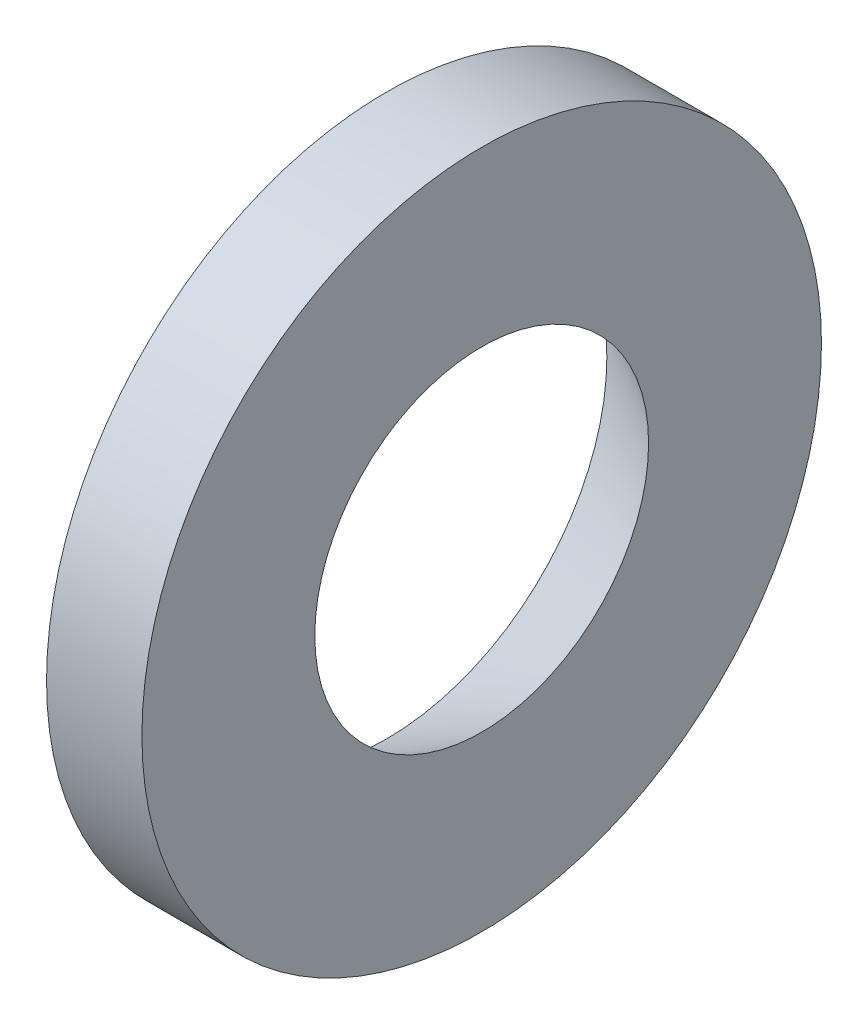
ISO-10303-21;
HEADER;
FILE_DESCRIPTION(('STEP AP214'),'2;1');
FILE_NAME('part.step','',(''),(''),'','','');
FILE_SCHEMA(('AUTOMOTIVE_DESIGN { 1 0 10303 214 1 1 1 1 }'));
ENDSEC;
DATA;
#1=APPLICATION_CONTEXT('core data for automotive mechanical design processes');
#2=APPLICATION_PROTOCOL_DEFINITION('international standard','automotive_design',2000,#1);
#3=PRODUCT_CONTEXT('',#1,'mechanical');
#4=PRODUCT('Part','Part','',(#3));
#5=PRODUCT_RELATED_PRODUCT_CATEGORY('part','',(#4));
#6=PRODUCT_DEFINITION_FORMATION('','',#4);
#7=PRODUCT_DEFINITION_CONTEXT('part definition',#1,'design');
#8=PRODUCT_DEFINITION('design','',#6,#7);
#9=PRODUCT_DEFINITION_SHAPE('','',#8);
#10=(LENGTH_UNIT() NAMED_UNIT(*) SI_UNIT(.MILLI.,.METRE.));
#11=(NAMED_UNIT(*) PLANE_ANGLE_UNIT() SI_UNIT($,.RADIAN.));
#12=(NAMED_UNIT(*) SI_UNIT($,.STERADIAN.) SOLID_ANGLE_UNIT());
#13=UNCERTAINTY_MEASURE_WITH_UNIT(LENGTH_MEASURE(1.E-05),#10,'distance_accuracy_value','');
#14=(GEOMETRIC_REPRESENTATION_CONTEXT(3) GLOBAL_UNCERTAINTY_ASSIGNED_CONTEXT((#13)) GLOBAL_UNIT_ASSIGNED_CONTEXT((#10,
#11,#12)) REPRESENTATION_CONTEXT('',''));
#15=CARTESIAN_POINT('',(0.,0.,0.));
#16=DIRECTION('',(0.,0.,1.));
#17=DIRECTION('',(1.,0.,0.));
#18=AXIS2_PLACEMENT_3D('',#15,#16,#17);
#19=CARTESIAN_POINT('',(0.,0.,0.));
#20=DIRECTION('',(-1.,0.,0.));
#21=DIRECTION('',(0.,0.,1.));
#22=AXIS2_PLACEMENT_3D('',#19,#20,#21);
#23=CONICAL_SURFACE('',#22,46.25,0.512389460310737);
#24=CARTESIAN_POINT('',(20.,0.,0.));
#25=DIRECTION('',(-1.,0.,0.));
#26=DIRECTION('',(0.,0.,1.));
#27=AXIS2_PLACEMENT_3D('',#24,#25,#26);
#28=CIRCLE('',#27,35.);
#29=CARTESIAN_POINT('',(20.,0.,35.));
#30=VERTEX_POINT('',#29);
#31=EDGE_CURVE('E45',#30,#30,#28,.T.);
#32=ORIENTED_EDGE('',*,*,#31,.F.);
#33=EDGE_LOOP('',(#32));
#34=FACE_BOUND('',#33,.T.);
#35=CARTESIAN_POINT('',(0.,0.,0.));
#36=DIRECTION('',(-1.,0.,0.));
#37=DIRECTION('',(0.,0.,1.));
#38=AXIS2_PLACEMENT_3D('',#35,#36,#37);
#39=CIRCLE('',#38,46.25);
#40=CARTESIAN_POINT('',(0.,0.,46.25));
#41=VERTEX_POINT('',#40);
#42=EDGE_CURVE('E10',#41,#41,#39,.T.);
#43=ORIENTED_EDGE('',*,*,#42,.T.);
#44=EDGE_LOOP('',(#43));
#45=FACE_BOUND('',#44,.T.);
#46=ADVANCED_FACE('F31',(#34,#45),#23,.F.);
#47=CARTESIAN_POINT('',(0.,46.25,0.));
#48=DIRECTION('',(1.,0.,0.));
#49=DIRECTION('',(0.,0.,-1.));
#50=AXIS2_PLACEMENT_3D('',#47,#48,#49);
#51=PLANE('',#50);
#52=ORIENTED_EDGE('',*,*,#42,.F.);
#53=EDGE_LOOP('',(#52));
#54=FACE_BOUND('',#53,.T.);
#55=CARTESIAN_POINT('',(0.,0.,0.));
#56=DIRECTION('',(-1.,0.,0.));
#57=DIRECTION('',(0.,0.,1.));
#58=AXIS2_PLACEMENT_3D('',#55,#56,#57);
#59=CIRCLE('',#58,71.25);
#60=CARTESIAN_POINT('',(0.,0.,71.25));
#61=VERTEX_POINT('',#60);
#62=EDGE_CURVE('E37',#61,#61,#59,.T.);
#63=ORIENTED_EDGE('',*,*,#62,.T.);
#64=EDGE_LOOP('',(#63));
#65=FACE_BOUND('',#64,.T.);
#66=ADVANCED_FACE('F54',(#54,#65),#51,.F.);
#67=CARTESIAN_POINT('',(0.,0.,0.));
#68=DIRECTION('',(-1.,0.,0.));
#69=DIRECTION('',(0.,0.,1.));
#70=AXIS2_PLACEMENT_3D('',#67,#68,#69);
#71=CYLINDRICAL_SURFACE('',#70,71.25);
#72=ORIENTED_EDGE('',*,*,#62,.F.);
#73=EDGE_LOOP('',(#72));
#74=FACE_BOUND('',#73,.T.);
#75=CARTESIAN_POINT('',(20.,0.,0.));
#76=DIRECTION('',(-1.,0.,0.));
#77=DIRECTION('',(0.,0.,1.));
#78=AXIS2_PLACEMENT_3D('',#75,#76,#77);
#79=CIRCLE('',#78,71.25);
#80=CARTESIAN_POINT('',(20.,0.,71.25));
#81=VERTEX_POINT('',#80);
#82=EDGE_CURVE('E41',#81,#81,#79,.T.);
#83=ORIENTED_EDGE('',*,*,#82,.T.);
#84=EDGE_LOOP('',(#83));
#85=FACE_BOUND('',#84,.T.);
#86=ADVANCED_FACE('F58',(#74,#85),#71,.T.);
#87=CARTESIAN_POINT('',(20.,71.25,0.));
#88=DIRECTION('',(-1.,0.,0.));
#89=DIRECTION('',(0.,0.,1.));
#90=AXIS2_PLACEMENT_3D('',#87,#88,#89);
#91=PLANE('',#90);
#92=ORIENTED_EDGE('',*,*,#82,.F.);
#93=EDGE_LOOP('',(#92));
#94=FACE_BOUND('',#93,.T.);
#95=ORIENTED_EDGE('',*,*,#31,.T.);
#96=EDGE_LOOP('',(#95));
#97=FACE_BOUND('',#96,.T.);
#98=ADVANCED_FACE('F51',(#94,#97),#91,.F.);
#99=CLOSED_SHELL('',(#46,#66,#86,#98));
#100=MANIFOLD_SOLID_BREP('B2',#99);
#101=ADVANCED_BREP_SHAPE_REPRESENTATION('',(#18,#100),#14);
#102=SHAPE_DEFINITION_REPRESENTATION(#9,#101);
ENDSEC;
END-ISO-10303-21;
